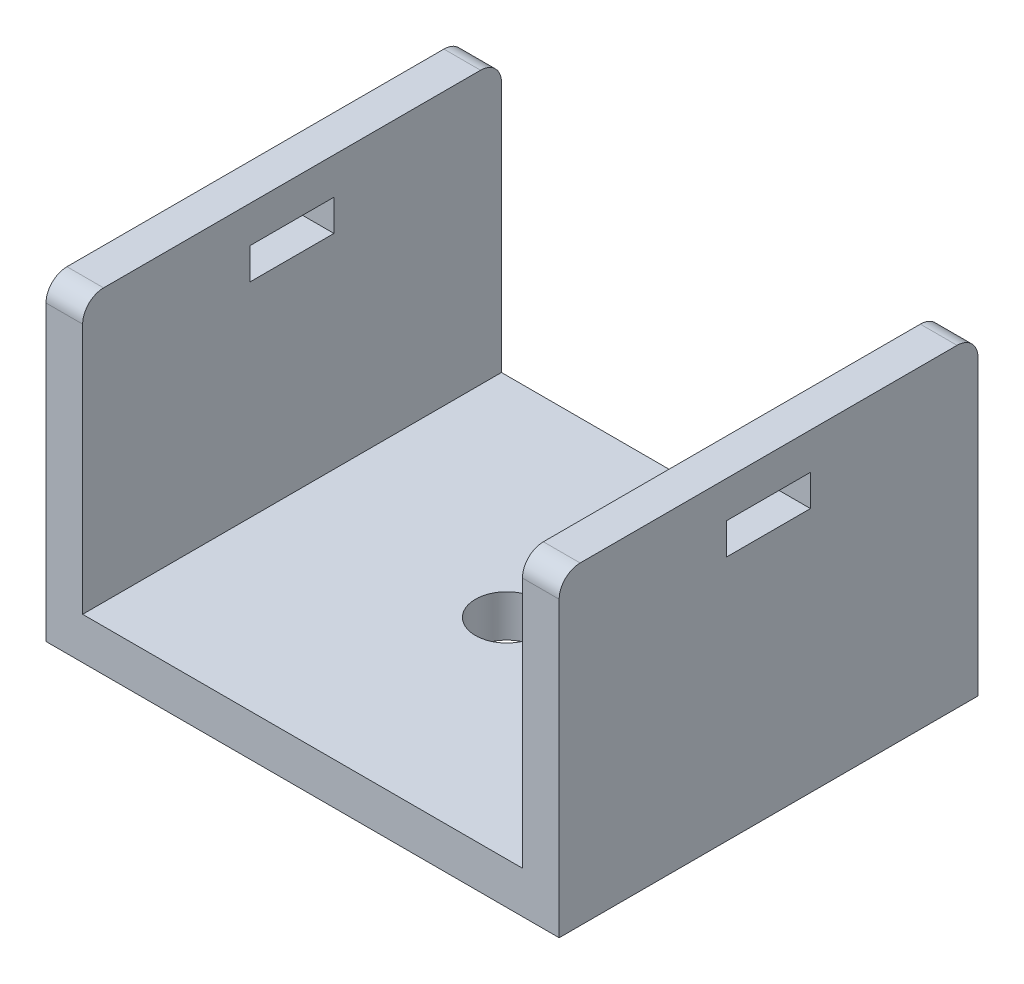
ISO-10303-21;
HEADER;
FILE_DESCRIPTION(('STEP AP214'),'2;1');
FILE_NAME('part.step','',(''),(''),'','','');
FILE_SCHEMA(('AUTOMOTIVE_DESIGN { 1 0 10303 214 1 1 1 1 }'));
ENDSEC;
DATA;
#1=APPLICATION_CONTEXT('core data for automotive mechanical design processes');
#2=APPLICATION_PROTOCOL_DEFINITION('international standard','automotive_design',2000,#1);
#3=PRODUCT_CONTEXT('',#1,'mechanical');
#4=PRODUCT('Part','Part','',(#3));
#5=PRODUCT_RELATED_PRODUCT_CATEGORY('part','',(#4));
#6=PRODUCT_DEFINITION_FORMATION('','',#4);
#7=PRODUCT_DEFINITION_CONTEXT('part definition',#1,'design');
#8=PRODUCT_DEFINITION('design','',#6,#7);
#9=PRODUCT_DEFINITION_SHAPE('','',#8);
#10=(LENGTH_UNIT() NAMED_UNIT(*) SI_UNIT(.MILLI.,.METRE.));
#11=(NAMED_UNIT(*) PLANE_ANGLE_UNIT() SI_UNIT($,.RADIAN.));
#12=(NAMED_UNIT(*) SI_UNIT($,.STERADIAN.) SOLID_ANGLE_UNIT());
#13=UNCERTAINTY_MEASURE_WITH_UNIT(LENGTH_MEASURE(1.E-05),#10,'distance_accuracy_value','');
#14=(GEOMETRIC_REPRESENTATION_CONTEXT(3) GLOBAL_UNCERTAINTY_ASSIGNED_CONTEXT((#13)) GLOBAL_UNIT_ASSIGNED_CONTEXT((#10,
#11,#12)) REPRESENTATION_CONTEXT('',''));
#15=CARTESIAN_POINT('',(0.,0.,0.));
#16=DIRECTION('',(0.,0.,1.));
#17=DIRECTION('',(1.,0.,0.));
#18=AXIS2_PLACEMENT_3D('',#15,#16,#17);
#19=CARTESIAN_POINT('',(24.5038267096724,0.,20.));
#20=DIRECTION('',(0.,1.,0.));
#21=DIRECTION('',(0.,0.,1.));
#22=AXIS2_PLACEMENT_3D('',#19,#20,#21);
#23=PLANE('',#22);
#24=CARTESIAN_POINT('',(12.0038267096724,0.,10.));
#25=DIRECTION('',(0.,-1.,0.));
#26=DIRECTION('',(0.,0.,-1.));
#27=AXIS2_PLACEMENT_3D('',#24,#25,#26);
#28=CIRCLE('',#27,1.5);
#29=CARTESIAN_POINT('',(12.0038267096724,0.,8.5));
#30=VERTEX_POINT('',#29);
#31=EDGE_CURVE('E298',#30,#30,#28,.T.);
#32=ORIENTED_EDGE('',*,*,#31,.F.);
#33=EDGE_LOOP('',(#32));
#34=FACE_BOUND('',#33,.T.);
#35=DIRECTION('',(1.,0.,0.));
#36=VECTOR('',#35,1.);
#37=CARTESIAN_POINT('',(24.5038267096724,0.,0.));
#38=LINE('',#37,#36);
#39=CARTESIAN_POINT('',(0.,0.,0.));
#40=VERTEX_POINT('',#39);
#41=CARTESIAN_POINT('',(24.5038267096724,0.,0.));
#42=VERTEX_POINT('',#41);
#43=EDGE_CURVE('E230',#40,#42,#38,.T.);
#44=ORIENTED_EDGE('',*,*,#43,.T.);
#45=DIRECTION('',(0.,0.,-1.));
#46=VECTOR('',#45,1.);
#47=CARTESIAN_POINT('',(24.5038267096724,0.,20.));
#48=LINE('',#47,#46);
#49=CARTESIAN_POINT('',(24.5038267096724,0.,20.));
#50=VERTEX_POINT('',#49);
#51=EDGE_CURVE('E279',#50,#42,#48,.T.);
#52=ORIENTED_EDGE('',*,*,#51,.F.);
#53=DIRECTION('',(1.,0.,0.));
#54=VECTOR('',#53,1.);
#55=CARTESIAN_POINT('',(24.5038267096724,0.,20.));
#56=LINE('',#55,#54);
#57=CARTESIAN_POINT('',(0.,0.,20.));
#58=VERTEX_POINT('',#57);
#59=EDGE_CURVE('E231',#58,#50,#56,.T.);
#60=ORIENTED_EDGE('',*,*,#59,.F.);
#61=DIRECTION('',(0.,0.,-1.));
#62=VECTOR('',#61,1.);
#63=CARTESIAN_POINT('',(0.,0.,20.));
#64=LINE('',#63,#62);
#65=EDGE_CURVE('E247',#58,#40,#64,.T.);
#66=ORIENTED_EDGE('',*,*,#65,.T.);
#67=EDGE_LOOP('',(#44,#52,#60,#66));
#68=FACE_BOUND('',#67,.T.);
#69=ADVANCED_FACE('F33',(#34,#68),#23,.F.);
#70=CARTESIAN_POINT('',(24.5038267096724,15.,20.));
#71=DIRECTION('',(-1.,0.,0.));
#72=DIRECTION('',(0.,0.,1.));
#73=AXIS2_PLACEMENT_3D('',#70,#71,#72);
#74=PLANE('',#73);
#75=DIRECTION('',(0.,0.,-1.));
#76=VECTOR('',#75,1.);
#77=CARTESIAN_POINT('',(24.5038267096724,11.75,12.));
#78=LINE('',#77,#76);
#79=CARTESIAN_POINT('',(24.5038267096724,11.75,12.));
#80=VERTEX_POINT('',#79);
#81=CARTESIAN_POINT('',(24.5038267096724,11.75,8.));
#82=VERTEX_POINT('',#81);
#83=EDGE_CURVE('E186',#80,#82,#78,.T.);
#84=ORIENTED_EDGE('',*,*,#83,.F.);
#85=DIRECTION('',(0.,-1.,0.));
#86=VECTOR('',#85,1.);
#87=CARTESIAN_POINT('',(24.5038267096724,13.25,12.));
#88=LINE('',#87,#86);
#89=CARTESIAN_POINT('',(24.5038267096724,13.25,12.));
#90=VERTEX_POINT('',#89);
#91=EDGE_CURVE('E192',#90,#80,#88,.T.);
#92=ORIENTED_EDGE('',*,*,#91,.F.);
#93=DIRECTION('',(0.,0.,1.));
#94=VECTOR('',#93,1.);
#95=CARTESIAN_POINT('',(24.5038267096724,13.25,12.));
#96=LINE('',#95,#94);
#97=CARTESIAN_POINT('',(24.5038267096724,13.25,8.));
#98=VERTEX_POINT('',#97);
#99=EDGE_CURVE('E197',#98,#90,#96,.T.);
#100=ORIENTED_EDGE('',*,*,#99,.F.);
#101=DIRECTION('',(0.,1.,0.));
#102=VECTOR('',#101,1.);
#103=CARTESIAN_POINT('',(24.5038267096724,13.25,8.));
#104=LINE('',#103,#102);
#105=EDGE_CURVE('E175',#82,#98,#104,.T.);
#106=ORIENTED_EDGE('',*,*,#105,.F.);
#107=EDGE_LOOP('',(#84,#92,#100,#106));
#108=FACE_BOUND('',#107,.T.);
#109=DIRECTION('',(0.,0.,-1.));
#110=VECTOR('',#109,1.);
#111=CARTESIAN_POINT('',(24.5038267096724,15.,20.));
#112=LINE('',#111,#110);
#113=CARTESIAN_POINT('',(24.5038267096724,15.,19.));
#114=VERTEX_POINT('',#113);
#115=CARTESIAN_POINT('',(24.5038267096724,15.,1.));
#116=VERTEX_POINT('',#115);
#117=EDGE_CURVE('E276',#114,#116,#112,.T.);
#118=ORIENTED_EDGE('',*,*,#117,.F.);
#119=CARTESIAN_POINT('',(24.5038267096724,14.,19.));
#120=DIRECTION('',(-1.,0.,0.));
#121=DIRECTION('',(0.,0.,1.));
#122=AXIS2_PLACEMENT_3D('',#119,#120,#121);
#123=CIRCLE('',#122,1.);
#124=CARTESIAN_POINT('',(24.5038267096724,14.,20.));
#125=VERTEX_POINT('',#124);
#126=EDGE_CURVE('E315',#114,#125,#123,.F.);
#127=ORIENTED_EDGE('',*,*,#126,.T.);
#128=DIRECTION('',(0.,1.,0.));
#129=VECTOR('',#128,1.);
#130=CARTESIAN_POINT('',(24.5038267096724,15.,20.));
#131=LINE('',#130,#129);
#132=EDGE_CURVE('E234',#50,#125,#131,.T.);
#133=ORIENTED_EDGE('',*,*,#132,.F.);
#134=ORIENTED_EDGE('',*,*,#51,.T.);
#135=DIRECTION('',(0.,1.,0.));
#136=VECTOR('',#135,1.);
#137=CARTESIAN_POINT('',(24.5038267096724,15.,0.));
#138=LINE('',#137,#136);
#139=CARTESIAN_POINT('',(24.5038267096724,14.,0.));
#140=VERTEX_POINT('',#139);
#141=EDGE_CURVE('E250',#42,#140,#138,.T.);
#142=ORIENTED_EDGE('',*,*,#141,.T.);
#143=CARTESIAN_POINT('',(24.5038267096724,14.,1.));
#144=DIRECTION('',(-1.,0.,0.));
#145=DIRECTION('',(0.,0.,1.));
#146=AXIS2_PLACEMENT_3D('',#143,#144,#145);
#147=CIRCLE('',#146,1.);
#148=EDGE_CURVE('E313',#140,#116,#147,.F.);
#149=ORIENTED_EDGE('',*,*,#148,.T.);
#150=EDGE_LOOP('',(#118,#127,#133,#134,#142,#149));
#151=FACE_BOUND('',#150,.T.);
#152=ADVANCED_FACE('F194',(#108,#151),#74,.F.);
#153=CARTESIAN_POINT('',(22.75,15.,20.));
#154=DIRECTION('',(0.,-1.,0.));
#155=DIRECTION('',(0.,0.,-1.));
#156=AXIS2_PLACEMENT_3D('',#153,#154,#155);
#157=PLANE('',#156);
#158=DIRECTION('',(0.,0.,-1.));
#159=VECTOR('',#158,1.);
#160=CARTESIAN_POINT('',(22.75,15.,20.));
#161=LINE('',#160,#159);
#162=CARTESIAN_POINT('',(22.75,15.,19.));
#163=VERTEX_POINT('',#162);
#164=CARTESIAN_POINT('',(22.75,15.,1.));
#165=VERTEX_POINT('',#164);
#166=EDGE_CURVE('E273',#163,#165,#161,.T.);
#167=ORIENTED_EDGE('',*,*,#166,.F.);
#168=DIRECTION('',(-1.,0.,0.));
#169=VECTOR('',#168,1.);
#170=CARTESIAN_POINT('',(22.75,15.,19.));
#171=LINE('',#170,#169);
#172=EDGE_CURVE('E311',#163,#114,#171,.F.);
#173=ORIENTED_EDGE('',*,*,#172,.T.);
#174=ORIENTED_EDGE('',*,*,#117,.T.);
#175=DIRECTION('',(-1.,0.,0.));
#176=VECTOR('',#175,1.);
#177=CARTESIAN_POINT('',(22.75,15.,1.));
#178=LINE('',#177,#176);
#179=EDGE_CURVE('E308',#116,#165,#178,.T.);
#180=ORIENTED_EDGE('',*,*,#179,.T.);
#181=EDGE_LOOP('',(#167,#173,#174,#180));
#182=FACE_BOUND('',#181,.T.);
#183=ADVANCED_FACE('F366',(#182),#157,.F.);
#184=CARTESIAN_POINT('',(22.75,2.,20.));
#185=DIRECTION('',(1.,0.,0.));
#186=DIRECTION('',(0.,1.,0.));
#187=AXIS2_PLACEMENT_3D('',#184,#185,#186);
#188=PLANE('',#187);
#189=DIRECTION('',(0.,0.,1.));
#190=VECTOR('',#189,1.);
#191=CARTESIAN_POINT('',(22.75,13.25,20.));
#192=LINE('',#191,#190);
#193=CARTESIAN_POINT('',(22.75,13.25,8.));
#194=VERTEX_POINT('',#193);
#195=CARTESIAN_POINT('',(22.75,13.25,12.));
#196=VERTEX_POINT('',#195);
#197=EDGE_CURVE('E221',#194,#196,#192,.T.);
#198=ORIENTED_EDGE('',*,*,#197,.T.);
#199=DIRECTION('',(0.,-1.,0.));
#200=VECTOR('',#199,1.);
#201=CARTESIAN_POINT('',(22.75,2.,12.));
#202=LINE('',#201,#200);
#203=CARTESIAN_POINT('',(22.75,11.75,12.));
#204=VERTEX_POINT('',#203);
#205=EDGE_CURVE('E227',#196,#204,#202,.T.);
#206=ORIENTED_EDGE('',*,*,#205,.T.);
#207=DIRECTION('',(0.,0.,-1.));
#208=VECTOR('',#207,1.);
#209=CARTESIAN_POINT('',(22.75,11.75,20.));
#210=LINE('',#209,#208);
#211=CARTESIAN_POINT('',(22.75,11.75,8.));
#212=VERTEX_POINT('',#211);
#213=EDGE_CURVE('E212',#204,#212,#210,.T.);
#214=ORIENTED_EDGE('',*,*,#213,.T.);
#215=DIRECTION('',(0.,1.,0.));
#216=VECTOR('',#215,1.);
#217=CARTESIAN_POINT('',(22.75,2.,8.));
#218=LINE('',#217,#216);
#219=EDGE_CURVE('E178',#212,#194,#218,.T.);
#220=ORIENTED_EDGE('',*,*,#219,.T.);
#221=EDGE_LOOP('',(#198,#206,#214,#220));
#222=FACE_BOUND('',#221,.T.);
#223=DIRECTION('',(0.,-1.,0.));
#224=VECTOR('',#223,1.);
#225=CARTESIAN_POINT('',(22.75,2.,20.));
#226=LINE('',#225,#224);
#227=CARTESIAN_POINT('',(22.75,14.,20.));
#228=VERTEX_POINT('',#227);
#229=CARTESIAN_POINT('',(22.75,2.,20.));
#230=VERTEX_POINT('',#229);
#231=EDGE_CURVE('E238',#228,#230,#226,.T.);
#232=ORIENTED_EDGE('',*,*,#231,.F.);
#233=CARTESIAN_POINT('',(22.75,14.,19.));
#234=DIRECTION('',(1.,0.,0.));
#235=DIRECTION('',(0.,1.,0.));
#236=AXIS2_PLACEMENT_3D('',#233,#234,#235);
#237=CIRCLE('',#236,1.);
#238=EDGE_CURVE('E306',#228,#163,#237,.F.);
#239=ORIENTED_EDGE('',*,*,#238,.T.);
#240=ORIENTED_EDGE('',*,*,#166,.T.);
#241=CARTESIAN_POINT('',(22.75,14.,1.));
#242=DIRECTION('',(1.,0.,0.));
#243=DIRECTION('',(0.,1.,0.));
#244=AXIS2_PLACEMENT_3D('',#241,#242,#243);
#245=CIRCLE('',#244,1.);
#246=CARTESIAN_POINT('',(22.75,14.,0.));
#247=VERTEX_POINT('',#246);
#248=EDGE_CURVE('E304',#165,#247,#245,.F.);
#249=ORIENTED_EDGE('',*,*,#248,.T.);
#250=DIRECTION('',(0.,-1.,0.));
#251=VECTOR('',#250,1.);
#252=CARTESIAN_POINT('',(22.75,2.,0.));
#253=LINE('',#252,#251);
#254=CARTESIAN_POINT('',(22.75,2.,0.));
#255=VERTEX_POINT('',#254);
#256=EDGE_CURVE('E253',#247,#255,#253,.T.);
#257=ORIENTED_EDGE('',*,*,#256,.T.);
#258=DIRECTION('',(0.,0.,-1.));
#259=VECTOR('',#258,1.);
#260=CARTESIAN_POINT('',(22.75,2.,20.));
#261=LINE('',#260,#259);
#262=EDGE_CURVE('E270',#230,#255,#261,.T.);
#263=ORIENTED_EDGE('',*,*,#262,.F.);
#264=EDGE_LOOP('',(#232,#239,#240,#249,#257,#263));
#265=FACE_BOUND('',#264,.T.);
#266=ADVANCED_FACE('F363',(#222,#265),#188,.F.);
#267=CARTESIAN_POINT('',(1.75,2.,20.));
#268=DIRECTION('',(0.,-1.,0.));
#269=DIRECTION('',(0.,0.,-1.));
#270=AXIS2_PLACEMENT_3D('',#267,#268,#269);
#271=PLANE('',#270);
#272=CARTESIAN_POINT('',(12.0038267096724,2.,10.));
#273=DIRECTION('',(0.,-1.,0.));
#274=DIRECTION('',(0.,0.,-1.));
#275=AXIS2_PLACEMENT_3D('',#272,#273,#274);
#276=CIRCLE('',#275,1.5);
#277=CARTESIAN_POINT('',(12.0038267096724,2.,8.5));
#278=VERTEX_POINT('',#277);
#279=EDGE_CURVE('E295',#278,#278,#276,.T.);
#280=ORIENTED_EDGE('',*,*,#279,.T.);
#281=EDGE_LOOP('',(#280));
#282=FACE_BOUND('',#281,.T.);
#283=DIRECTION('',(-1.,0.,0.));
#284=VECTOR('',#283,1.);
#285=CARTESIAN_POINT('',(1.75,2.,0.));
#286=LINE('',#285,#284);
#287=CARTESIAN_POINT('',(1.75,2.,0.));
#288=VERTEX_POINT('',#287);
#289=EDGE_CURVE('E255',#255,#288,#286,.T.);
#290=ORIENTED_EDGE('',*,*,#289,.T.);
#291=DIRECTION('',(0.,0.,-1.));
#292=VECTOR('',#291,1.);
#293=CARTESIAN_POINT('',(1.75,2.,20.));
#294=LINE('',#293,#292);
#295=CARTESIAN_POINT('',(1.75,2.,20.));
#296=VERTEX_POINT('',#295);
#297=EDGE_CURVE('E267',#296,#288,#294,.T.);
#298=ORIENTED_EDGE('',*,*,#297,.F.);
#299=DIRECTION('',(-1.,0.,0.));
#300=VECTOR('',#299,1.);
#301=CARTESIAN_POINT('',(1.75,2.,20.));
#302=LINE('',#301,#300);
#303=EDGE_CURVE('E240',#230,#296,#302,.T.);
#304=ORIENTED_EDGE('',*,*,#303,.F.);
#305=ORIENTED_EDGE('',*,*,#262,.T.);
#306=EDGE_LOOP('',(#290,#298,#304,#305));
#307=FACE_BOUND('',#306,.T.);
#308=ADVANCED_FACE('F375',(#282,#307),#271,.F.);
#309=CARTESIAN_POINT('',(1.75,15.,20.));
#310=DIRECTION('',(-1.,0.,0.));
#311=DIRECTION('',(0.,-1.,0.));
#312=AXIS2_PLACEMENT_3D('',#309,#310,#311);
#313=PLANE('',#312);
#314=DIRECTION('',(0.,0.,1.));
#315=VECTOR('',#314,1.);
#316=CARTESIAN_POINT('',(1.75,11.75,20.));
#317=LINE('',#316,#315);
#318=CARTESIAN_POINT('',(1.75,11.75,8.));
#319=VERTEX_POINT('',#318);
#320=CARTESIAN_POINT('',(1.75,11.75,12.));
#321=VERTEX_POINT('',#320);
#322=EDGE_CURVE('E209',#319,#321,#317,.T.);
#323=ORIENTED_EDGE('',*,*,#322,.T.);
#324=DIRECTION('',(0.,1.,0.));
#325=VECTOR('',#324,1.);
#326=CARTESIAN_POINT('',(1.75,15.,12.));
#327=LINE('',#326,#325);
#328=CARTESIAN_POINT('',(1.75,13.25,12.));
#329=VERTEX_POINT('',#328);
#330=EDGE_CURVE('E224',#321,#329,#327,.T.);
#331=ORIENTED_EDGE('',*,*,#330,.T.);
#332=DIRECTION('',(0.,0.,-1.));
#333=VECTOR('',#332,1.);
#334=CARTESIAN_POINT('',(1.75,13.25,20.));
#335=LINE('',#334,#333);
#336=CARTESIAN_POINT('',(1.75,13.25,8.));
#337=VERTEX_POINT('',#336);
#338=EDGE_CURVE('E218',#329,#337,#335,.T.);
#339=ORIENTED_EDGE('',*,*,#338,.T.);
#340=DIRECTION('',(0.,-1.,0.));
#341=VECTOR('',#340,1.);
#342=CARTESIAN_POINT('',(1.75,15.,8.));
#343=LINE('',#342,#341);
#344=EDGE_CURVE('E214',#337,#319,#343,.T.);
#345=ORIENTED_EDGE('',*,*,#344,.T.);
#346=EDGE_LOOP('',(#323,#331,#339,#345));
#347=FACE_BOUND('',#346,.T.);
#348=DIRECTION('',(0.,1.,0.));
#349=VECTOR('',#348,1.);
#350=CARTESIAN_POINT('',(1.75,15.,0.));
#351=LINE('',#350,#349);
#352=CARTESIAN_POINT('',(1.75,14.,0.));
#353=VERTEX_POINT('',#352);
#354=EDGE_CURVE('E257',#288,#353,#351,.T.);
#355=ORIENTED_EDGE('',*,*,#354,.T.);
#356=CARTESIAN_POINT('',(1.75,14.,1.));
#357=DIRECTION('',(-1.,0.,0.));
#358=DIRECTION('',(0.,-1.,0.));
#359=AXIS2_PLACEMENT_3D('',#356,#357,#358);
#360=CIRCLE('',#359,1.);
#361=CARTESIAN_POINT('',(1.75,15.,1.));
#362=VERTEX_POINT('',#361);
#363=EDGE_CURVE('E11',#353,#362,#360,.F.);
#364=ORIENTED_EDGE('',*,*,#363,.T.);
#365=DIRECTION('',(0.,0.,-1.));
#366=VECTOR('',#365,1.);
#367=CARTESIAN_POINT('',(1.75,15.,20.));
#368=LINE('',#367,#366);
#369=CARTESIAN_POINT('',(1.75,15.,19.));
#370=VERTEX_POINT('',#369);
#371=EDGE_CURVE('E265',#370,#362,#368,.T.);
#372=ORIENTED_EDGE('',*,*,#371,.F.);
#373=CARTESIAN_POINT('',(1.75,14.,19.));
#374=DIRECTION('',(-1.,0.,0.));
#375=DIRECTION('',(0.,-1.,0.));
#376=AXIS2_PLACEMENT_3D('',#373,#374,#375);
#377=CIRCLE('',#376,1.);
#378=CARTESIAN_POINT('',(1.75,14.,20.));
#379=VERTEX_POINT('',#378);
#380=EDGE_CURVE('E41',#370,#379,#377,.F.);
#381=ORIENTED_EDGE('',*,*,#380,.T.);
#382=DIRECTION('',(0.,1.,0.));
#383=VECTOR('',#382,1.);
#384=CARTESIAN_POINT('',(1.75,15.,20.));
#385=LINE('',#384,#383);
#386=EDGE_CURVE('E242',#296,#379,#385,.T.);
#387=ORIENTED_EDGE('',*,*,#386,.F.);
#388=ORIENTED_EDGE('',*,*,#297,.T.);
#389=EDGE_LOOP('',(#355,#364,#372,#381,#387,#388));
#390=FACE_BOUND('',#389,.T.);
#391=ADVANCED_FACE('F330',(#347,#390),#313,.F.);
#392=CARTESIAN_POINT('',(0.,15.,20.));
#393=DIRECTION('',(0.,-1.,0.));
#394=DIRECTION('',(0.,0.,-1.));
#395=AXIS2_PLACEMENT_3D('',#392,#393,#394);
#396=PLANE('',#395);
#397=ORIENTED_EDGE('',*,*,#371,.T.);
#398=DIRECTION('',(-1.,0.,0.));
#399=VECTOR('',#398,1.);
#400=CARTESIAN_POINT('',(0.,15.,1.));
#401=LINE('',#400,#399);
#402=CARTESIAN_POINT('',(0.,15.,1.));
#403=VERTEX_POINT('',#402);
#404=EDGE_CURVE('E322',#362,#403,#401,.T.);
#405=ORIENTED_EDGE('',*,*,#404,.T.);
#406=DIRECTION('',(0.,0.,-1.));
#407=VECTOR('',#406,1.);
#408=CARTESIAN_POINT('',(0.,15.,20.));
#409=LINE('',#408,#407);
#410=CARTESIAN_POINT('',(0.,15.,19.));
#411=VERTEX_POINT('',#410);
#412=EDGE_CURVE('E262',#411,#403,#409,.T.);
#413=ORIENTED_EDGE('',*,*,#412,.F.);
#414=DIRECTION('',(-1.,0.,0.));
#415=VECTOR('',#414,1.);
#416=CARTESIAN_POINT('',(0.,15.,19.));
#417=LINE('',#416,#415);
#418=EDGE_CURVE('E53',#411,#370,#417,.F.);
#419=ORIENTED_EDGE('',*,*,#418,.T.);
#420=EDGE_LOOP('',(#397,#405,#413,#419));
#421=FACE_BOUND('',#420,.T.);
#422=ADVANCED_FACE('F341',(#421),#396,.F.);
#423=CARTESIAN_POINT('',(0.,0.,20.));
#424=DIRECTION('',(1.,0.,0.));
#425=DIRECTION('',(0.,0.,-1.));
#426=AXIS2_PLACEMENT_3D('',#423,#424,#425);
#427=PLANE('',#426);
#428=DIRECTION('',(0.,0.,1.));
#429=VECTOR('',#428,1.);
#430=CARTESIAN_POINT('',(0.,13.25,20.));
#431=LINE('',#430,#429);
#432=CARTESIAN_POINT('',(0.,13.25,8.));
#433=VERTEX_POINT('',#432);
#434=CARTESIAN_POINT('',(0.,13.25,12.));
#435=VERTEX_POINT('',#434);
#436=EDGE_CURVE('E288',#433,#435,#431,.T.);
#437=ORIENTED_EDGE('',*,*,#436,.T.);
#438=DIRECTION('',(0.,-1.,0.));
#439=VECTOR('',#438,1.);
#440=CARTESIAN_POINT('',(0.,0.,12.));
#441=LINE('',#440,#439);
#442=CARTESIAN_POINT('',(0.,11.75,12.));
#443=VERTEX_POINT('',#442);
#444=EDGE_CURVE('E291',#435,#443,#441,.T.);
#445=ORIENTED_EDGE('',*,*,#444,.T.);
#446=DIRECTION('',(0.,0.,-1.));
#447=VECTOR('',#446,1.);
#448=CARTESIAN_POINT('',(0.,11.75,20.));
#449=LINE('',#448,#447);
#450=CARTESIAN_POINT('',(0.,11.75,8.));
#451=VERTEX_POINT('',#450);
#452=EDGE_CURVE('E282',#443,#451,#449,.T.);
#453=ORIENTED_EDGE('',*,*,#452,.T.);
#454=DIRECTION('',(0.,1.,0.));
#455=VECTOR('',#454,1.);
#456=CARTESIAN_POINT('',(0.,0.,8.));
#457=LINE('',#456,#455);
#458=EDGE_CURVE('E285',#451,#433,#457,.T.);
#459=ORIENTED_EDGE('',*,*,#458,.T.);
#460=EDGE_LOOP('',(#437,#445,#453,#459));
#461=FACE_BOUND('',#460,.T.);
#462=ORIENTED_EDGE('',*,*,#412,.T.);
#463=CARTESIAN_POINT('',(0.,14.,1.));
#464=DIRECTION('',(1.,0.,0.));
#465=DIRECTION('',(0.,0.,-1.));
#466=AXIS2_PLACEMENT_3D('',#463,#464,#465);
#467=CIRCLE('',#466,1.);
#468=CARTESIAN_POINT('',(0.,14.,0.));
#469=VERTEX_POINT('',#468);
#470=EDGE_CURVE('E327',#403,#469,#467,.F.);
#471=ORIENTED_EDGE('',*,*,#470,.T.);
#472=DIRECTION('',(0.,-1.,0.));
#473=VECTOR('',#472,1.);
#474=CARTESIAN_POINT('',(0.,0.,0.));
#475=LINE('',#474,#473);
#476=EDGE_CURVE('E235',#469,#40,#475,.T.);
#477=ORIENTED_EDGE('',*,*,#476,.T.);
#478=ORIENTED_EDGE('',*,*,#65,.F.);
#479=DIRECTION('',(0.,-1.,0.));
#480=VECTOR('',#479,1.);
#481=CARTESIAN_POINT('',(0.,0.,20.));
#482=LINE('',#481,#480);
#483=CARTESIAN_POINT('',(0.,14.,20.));
#484=VERTEX_POINT('',#483);
#485=EDGE_CURVE('E245',#484,#58,#482,.T.);
#486=ORIENTED_EDGE('',*,*,#485,.F.);
#487=CARTESIAN_POINT('',(0.,14.,19.));
#488=DIRECTION('',(1.,0.,0.));
#489=DIRECTION('',(0.,0.,-1.));
#490=AXIS2_PLACEMENT_3D('',#487,#488,#489);
#491=CIRCLE('',#490,1.);
#492=EDGE_CURVE('E325',#484,#411,#491,.F.);
#493=ORIENTED_EDGE('',*,*,#492,.T.);
#494=EDGE_LOOP('',(#462,#471,#477,#478,#486,#493));
#495=FACE_BOUND('',#494,.T.);
#496=ADVANCED_FACE('F339',(#461,#495),#427,.F.);
#497=CARTESIAN_POINT('',(0.,0.,20.));
#498=DIRECTION('',(0.,0.,-1.));
#499=DIRECTION('',(-1.,0.,0.));
#500=AXIS2_PLACEMENT_3D('',#497,#498,#499);
#501=PLANE('',#500);
#502=ORIENTED_EDGE('',*,*,#132,.T.);
#503=DIRECTION('',(-1.,0.,0.));
#504=VECTOR('',#503,1.);
#505=CARTESIAN_POINT('',(0.,14.,20.));
#506=LINE('',#505,#504);
#507=EDGE_CURVE('E301',#125,#228,#506,.T.);
#508=ORIENTED_EDGE('',*,*,#507,.T.);
#509=ORIENTED_EDGE('',*,*,#231,.T.);
#510=ORIENTED_EDGE('',*,*,#303,.T.);
#511=ORIENTED_EDGE('',*,*,#386,.T.);
#512=DIRECTION('',(-1.,0.,0.));
#513=VECTOR('',#512,1.);
#514=CARTESIAN_POINT('',(0.,14.,20.));
#515=LINE('',#514,#513);
#516=EDGE_CURVE('E294',#379,#484,#515,.T.);
#517=ORIENTED_EDGE('',*,*,#516,.T.);
#518=ORIENTED_EDGE('',*,*,#485,.T.);
#519=ORIENTED_EDGE('',*,*,#59,.T.);
#520=EDGE_LOOP('',(#502,#508,#509,#510,#511,#517,#518,#519));
#521=FACE_BOUND('',#520,.T.);
#522=ADVANCED_FACE('F334',(#521),#501,.F.);
#523=CARTESIAN_POINT('',(0.,0.,0.));
#524=DIRECTION('',(0.,0.,-1.));
#525=DIRECTION('',(-1.,0.,0.));
#526=AXIS2_PLACEMENT_3D('',#523,#524,#525);
#527=PLANE('',#526);
#528=ORIENTED_EDGE('',*,*,#256,.F.);
#529=DIRECTION('',(-1.,0.,0.));
#530=VECTOR('',#529,1.);
#531=CARTESIAN_POINT('',(24.5038267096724,14.,0.));
#532=LINE('',#531,#530);
#533=EDGE_CURVE('E319',#247,#140,#532,.F.);
#534=ORIENTED_EDGE('',*,*,#533,.T.);
#535=ORIENTED_EDGE('',*,*,#141,.F.);
#536=ORIENTED_EDGE('',*,*,#43,.F.);
#537=ORIENTED_EDGE('',*,*,#476,.F.);
#538=DIRECTION('',(-1.,0.,0.));
#539=VECTOR('',#538,1.);
#540=CARTESIAN_POINT('',(1.75,14.,0.));
#541=LINE('',#540,#539);
#542=EDGE_CURVE('E317',#469,#353,#541,.F.);
#543=ORIENTED_EDGE('',*,*,#542,.T.);
#544=ORIENTED_EDGE('',*,*,#354,.F.);
#545=ORIENTED_EDGE('',*,*,#289,.F.);
#546=EDGE_LOOP('',(#528,#534,#535,#536,#537,#543,#544,#545));
#547=FACE_BOUND('',#546,.T.);
#548=ADVANCED_FACE('F350',(#547),#527,.T.);
#549=CARTESIAN_POINT('',(-5.4961732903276,11.75,12.));
#550=DIRECTION('',(0.,-1.,0.));
#551=DIRECTION('',(0.,0.,-1.));
#552=AXIS2_PLACEMENT_3D('',#549,#550,#551);
#553=PLANE('',#552);
#554=DIRECTION('',(1.,0.,0.));
#555=VECTOR('',#554,1.);
#556=CARTESIAN_POINT('',(-5.4961732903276,11.75,8.));
#557=LINE('',#556,#555);
#558=EDGE_CURVE('E181',#451,#319,#557,.T.);
#559=ORIENTED_EDGE('',*,*,#558,.F.);
#560=ORIENTED_EDGE('',*,*,#452,.F.);
#561=DIRECTION('',(1.,0.,0.));
#562=VECTOR('',#561,1.);
#563=CARTESIAN_POINT('',(-5.4961732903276,11.75,12.));
#564=LINE('',#563,#562);
#565=EDGE_CURVE('E182',#443,#321,#564,.T.);
#566=ORIENTED_EDGE('',*,*,#565,.T.);
#567=ORIENTED_EDGE('',*,*,#322,.F.);
#568=EDGE_LOOP('',(#559,#560,#566,#567));
#569=FACE_BOUND('',#568,.T.);
#570=ADVANCED_FACE('F435',(#569),#553,.F.);
#571=CARTESIAN_POINT('',(-5.4961732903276,13.25,8.));
#572=DIRECTION('',(0.,0.,-1.));
#573=DIRECTION('',(-1.,0.,0.));
#574=AXIS2_PLACEMENT_3D('',#571,#572,#573);
#575=PLANE('',#574);
#576=DIRECTION('',(1.,0.,0.));
#577=VECTOR('',#576,1.);
#578=CARTESIAN_POINT('',(-5.4961732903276,13.25,8.));
#579=LINE('',#578,#577);
#580=EDGE_CURVE('E205',#433,#337,#579,.T.);
#581=ORIENTED_EDGE('',*,*,#580,.F.);
#582=ORIENTED_EDGE('',*,*,#458,.F.);
#583=ORIENTED_EDGE('',*,*,#558,.T.);
#584=ORIENTED_EDGE('',*,*,#344,.F.);
#585=EDGE_LOOP('',(#581,#582,#583,#584));
#586=FACE_BOUND('',#585,.T.);
#587=ADVANCED_FACE('F492',(#586),#575,.F.);
#588=CARTESIAN_POINT('',(-5.4961732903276,13.25,12.));
#589=DIRECTION('',(0.,1.,0.));
#590=DIRECTION('',(0.,0.,1.));
#591=AXIS2_PLACEMENT_3D('',#588,#589,#590);
#592=PLANE('',#591);
#593=DIRECTION('',(1.,0.,0.));
#594=VECTOR('',#593,1.);
#595=CARTESIAN_POINT('',(-5.4961732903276,13.25,12.));
#596=LINE('',#595,#594);
#597=EDGE_CURVE('E204',#435,#329,#596,.T.);
#598=ORIENTED_EDGE('',*,*,#597,.F.);
#599=ORIENTED_EDGE('',*,*,#436,.F.);
#600=ORIENTED_EDGE('',*,*,#580,.T.);
#601=ORIENTED_EDGE('',*,*,#338,.F.);
#602=EDGE_LOOP('',(#598,#599,#600,#601));
#603=FACE_BOUND('',#602,.T.);
#604=ADVANCED_FACE('F501',(#603),#592,.F.);
#605=CARTESIAN_POINT('',(-5.4961732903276,13.25,12.));
#606=DIRECTION('',(0.,0.,1.));
#607=DIRECTION('',(1.,0.,0.));
#608=AXIS2_PLACEMENT_3D('',#605,#606,#607);
#609=PLANE('',#608);
#610=ORIENTED_EDGE('',*,*,#565,.F.);
#611=ORIENTED_EDGE('',*,*,#444,.F.);
#612=ORIENTED_EDGE('',*,*,#597,.T.);
#613=ORIENTED_EDGE('',*,*,#330,.F.);
#614=EDGE_LOOP('',(#610,#611,#612,#613));
#615=FACE_BOUND('',#614,.T.);
#616=ADVANCED_FACE('F507',(#615),#609,.F.);
#617=EDGE_CURVE('E202',#196,#90,#596,.T.);
#618=ORIENTED_EDGE('',*,*,#617,.T.);
#619=ORIENTED_EDGE('',*,*,#91,.T.);
#620=EDGE_CURVE('E189',#204,#80,#564,.T.);
#621=ORIENTED_EDGE('',*,*,#620,.F.);
#622=ORIENTED_EDGE('',*,*,#205,.F.);
#623=EDGE_LOOP('',(#618,#619,#621,#622));
#624=FACE_BOUND('',#623,.T.);
#625=ADVANCED_FACE('F498',(#624),#609,.F.);
#626=EDGE_CURVE('E206',#194,#98,#579,.T.);
#627=ORIENTED_EDGE('',*,*,#626,.T.);
#628=ORIENTED_EDGE('',*,*,#99,.T.);
#629=ORIENTED_EDGE('',*,*,#617,.F.);
#630=ORIENTED_EDGE('',*,*,#197,.F.);
#631=EDGE_LOOP('',(#627,#628,#629,#630));
#632=FACE_BOUND('',#631,.T.);
#633=ADVANCED_FACE('F490',(#632),#592,.F.);
#634=EDGE_CURVE('E170',#212,#82,#557,.T.);
#635=ORIENTED_EDGE('',*,*,#634,.T.);
#636=ORIENTED_EDGE('',*,*,#105,.T.);
#637=ORIENTED_EDGE('',*,*,#626,.F.);
#638=ORIENTED_EDGE('',*,*,#219,.F.);
#639=EDGE_LOOP('',(#635,#636,#637,#638));
#640=FACE_BOUND('',#639,.T.);
#641=ADVANCED_FACE('F172',(#640),#575,.F.);
#642=ORIENTED_EDGE('',*,*,#620,.T.);
#643=ORIENTED_EDGE('',*,*,#83,.T.);
#644=ORIENTED_EDGE('',*,*,#634,.F.);
#645=ORIENTED_EDGE('',*,*,#213,.F.);
#646=EDGE_LOOP('',(#642,#643,#644,#645));
#647=FACE_BOUND('',#646,.T.);
#648=ADVANCED_FACE('F187',(#647),#553,.F.);
#649=CARTESIAN_POINT('',(12.0038267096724,10.,10.));
#650=DIRECTION('',(0.,-1.,0.));
#651=DIRECTION('',(0.,0.,-1.));
#652=AXIS2_PLACEMENT_3D('',#649,#650,#651);
#653=CYLINDRICAL_SURFACE('',#652,1.5);
#654=ORIENTED_EDGE('',*,*,#31,.T.);
#655=EDGE_LOOP('',(#654));
#656=FACE_BOUND('',#655,.T.);
#657=ORIENTED_EDGE('',*,*,#279,.F.);
#658=EDGE_LOOP('',(#657));
#659=FACE_BOUND('',#658,.T.);
#660=ADVANCED_FACE('F401',(#656,#659),#653,.F.);
#661=CARTESIAN_POINT('',(0.,14.,19.));
#662=DIRECTION('',(-1.,0.,0.));
#663=DIRECTION('',(0.,0.,1.));
#664=AXIS2_PLACEMENT_3D('',#661,#662,#663);
#665=CYLINDRICAL_SURFACE('',#664,1.);
#666=ORIENTED_EDGE('',*,*,#126,.F.);
#667=ORIENTED_EDGE('',*,*,#172,.F.);
#668=ORIENTED_EDGE('',*,*,#238,.F.);
#669=ORIENTED_EDGE('',*,*,#507,.F.);
#670=EDGE_LOOP('',(#666,#667,#668,#669));
#671=FACE_BOUND('',#670,.T.);
#672=ADVANCED_FACE('F359',(#671),#665,.T.);
#673=CARTESIAN_POINT('',(22.75,14.,1.));
#674=DIRECTION('',(1.,0.,0.));
#675=DIRECTION('',(0.,0.,-1.));
#676=AXIS2_PLACEMENT_3D('',#673,#674,#675);
#677=CYLINDRICAL_SURFACE('',#676,1.);
#678=ORIENTED_EDGE('',*,*,#148,.F.);
#679=ORIENTED_EDGE('',*,*,#533,.F.);
#680=ORIENTED_EDGE('',*,*,#248,.F.);
#681=ORIENTED_EDGE('',*,*,#179,.F.);
#682=EDGE_LOOP('',(#678,#679,#680,#681));
#683=FACE_BOUND('',#682,.T.);
#684=ADVANCED_FACE('F371',(#683),#677,.T.);
#685=CARTESIAN_POINT('',(0.,14.,1.));
#686=DIRECTION('',(1.,0.,0.));
#687=DIRECTION('',(0.,0.,-1.));
#688=AXIS2_PLACEMENT_3D('',#685,#686,#687);
#689=CYLINDRICAL_SURFACE('',#688,1.);
#690=ORIENTED_EDGE('',*,*,#363,.F.);
#691=ORIENTED_EDGE('',*,*,#542,.F.);
#692=ORIENTED_EDGE('',*,*,#470,.F.);
#693=ORIENTED_EDGE('',*,*,#404,.F.);
#694=EDGE_LOOP('',(#690,#691,#692,#693));
#695=FACE_BOUND('',#694,.T.);
#696=ADVANCED_FACE('F344',(#695),#689,.T.);
#697=CARTESIAN_POINT('',(0.,14.,19.));
#698=DIRECTION('',(-1.,0.,0.));
#699=DIRECTION('',(0.,0.,1.));
#700=AXIS2_PLACEMENT_3D('',#697,#698,#699);
#701=CYLINDRICAL_SURFACE('',#700,1.);
#702=ORIENTED_EDGE('',*,*,#380,.F.);
#703=ORIENTED_EDGE('',*,*,#418,.F.);
#704=ORIENTED_EDGE('',*,*,#492,.F.);
#705=ORIENTED_EDGE('',*,*,#516,.F.);
#706=EDGE_LOOP('',(#702,#703,#704,#705));
#707=FACE_BOUND('',#706,.T.);
#708=ADVANCED_FACE('F35',(#707),#701,.T.);
#709=CLOSED_SHELL('',(#69,#152,#183,#266,#308,#391,#422,#496,#522,#548,#570,#587,#604,#616,#625,
#633,#641,#648,#660,#672,#684,#696,#708));
#710=MANIFOLD_SOLID_BREP('B2',#709);
#711=ADVANCED_BREP_SHAPE_REPRESENTATION('',(#18,#710),#14);
#712=SHAPE_DEFINITION_REPRESENTATION(#9,#711);
ENDSEC;
END-ISO-10303-21;
